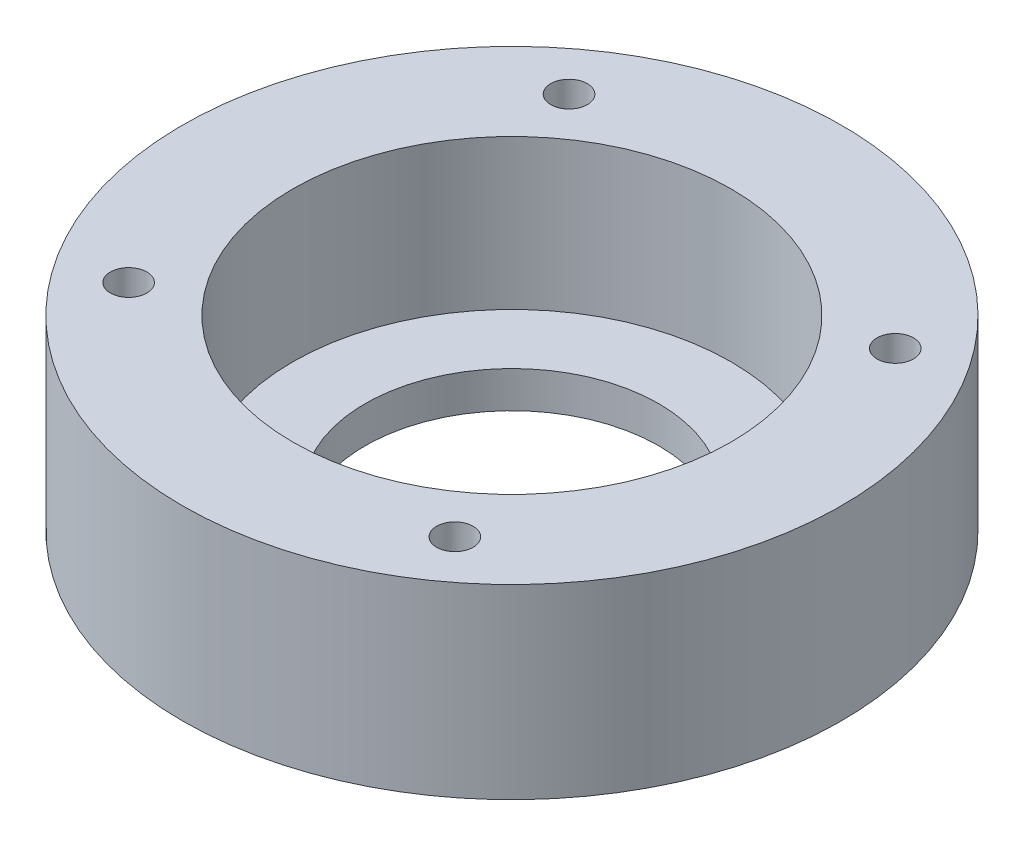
ISO-10303-21;
HEADER;
FILE_DESCRIPTION(('STEP AP214'),'2;1');
FILE_NAME('part.step','',(''),(''),'','','');
FILE_SCHEMA(('AUTOMOTIVE_DESIGN { 1 0 10303 214 1 1 1 1 }'));
ENDSEC;
DATA;
#1=APPLICATION_CONTEXT('core data for automotive mechanical design processes');
#2=APPLICATION_PROTOCOL_DEFINITION('international standard','automotive_design',2000,#1);
#3=PRODUCT_CONTEXT('',#1,'mechanical');
#4=PRODUCT('Part','Part','',(#3));
#5=PRODUCT_RELATED_PRODUCT_CATEGORY('part','',(#4));
#6=PRODUCT_DEFINITION_FORMATION('','',#4);
#7=PRODUCT_DEFINITION_CONTEXT('part definition',#1,'design');
#8=PRODUCT_DEFINITION('design','',#6,#7);
#9=PRODUCT_DEFINITION_SHAPE('','',#8);
#10=(LENGTH_UNIT() NAMED_UNIT(*) SI_UNIT(.MILLI.,.METRE.));
#11=(NAMED_UNIT(*) PLANE_ANGLE_UNIT() SI_UNIT($,.RADIAN.));
#12=(NAMED_UNIT(*) SI_UNIT($,.STERADIAN.) SOLID_ANGLE_UNIT());
#13=UNCERTAINTY_MEASURE_WITH_UNIT(LENGTH_MEASURE(1.E-05),#10,'distance_accuracy_value','');
#14=(GEOMETRIC_REPRESENTATION_CONTEXT(3) GLOBAL_UNCERTAINTY_ASSIGNED_CONTEXT((#13)) GLOBAL_UNIT_ASSIGNED_CONTEXT((#10,
#11,#12)) REPRESENTATION_CONTEXT('',''));
#15=CARTESIAN_POINT('',(0.,0.,0.));
#16=DIRECTION('',(0.,0.,1.));
#17=DIRECTION('',(1.,0.,0.));
#18=AXIS2_PLACEMENT_3D('',#15,#16,#17);
#19=CARTESIAN_POINT('',(0.,77.6026104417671,0.));
#20=DIRECTION('',(0.,1.,0.));
#21=DIRECTION('',(0.,0.,1.));
#22=AXIS2_PLACEMENT_3D('',#19,#20,#21);
#23=CYLINDRICAL_SURFACE('',#22,20.1);
#24=CARTESIAN_POINT('',(0.,0.,0.));
#25=DIRECTION('',(0.,1.,0.));
#26=DIRECTION('',(0.,0.,1.));
#27=AXIS2_PLACEMENT_3D('',#24,#25,#26);
#28=CIRCLE('',#27,20.1);
#29=CARTESIAN_POINT('',(0.,0.,20.1));
#30=VERTEX_POINT('',#29);
#31=EDGE_CURVE('E10',#30,#30,#28,.T.);
#32=ORIENTED_EDGE('',*,*,#31,.F.);
#33=EDGE_LOOP('',(#32));
#34=FACE_BOUND('',#33,.T.);
#35=CARTESIAN_POINT('',(0.,5.,0.));
#36=DIRECTION('',(0.,1.,0.));
#37=DIRECTION('',(0.,0.,1.));
#38=AXIS2_PLACEMENT_3D('',#35,#36,#37);
#39=CIRCLE('',#38,20.1);
#40=CARTESIAN_POINT('',(0.,5.,20.1));
#41=VERTEX_POINT('',#40);
#42=EDGE_CURVE('E50',#41,#41,#39,.T.);
#43=ORIENTED_EDGE('',*,*,#42,.T.);
#44=EDGE_LOOP('',(#43));
#45=FACE_BOUND('',#44,.T.);
#46=ADVANCED_FACE('F28',(#34,#45),#23,.F.);
#47=CARTESIAN_POINT('',(20.1,0.,0.));
#48=DIRECTION('',(0.,1.,0.));
#49=DIRECTION('',(0.,0.,1.));
#50=AXIS2_PLACEMENT_3D('',#47,#48,#49);
#51=PLANE('',#50);
#52=CARTESIAN_POINT('',(30.1328551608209,0.,-22.3217615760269));
#53=DIRECTION('',(0.,-1.,0.));
#54=DIRECTION('',(0.,0.,-1.));
#55=AXIS2_PLACEMENT_3D('',#52,#53,#54);
#56=CIRCLE('',#55,2.49999999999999);
#57=CARTESIAN_POINT('',(30.1328551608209,0.,-24.8217615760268));
#58=VERTEX_POINT('',#57);
#59=EDGE_CURVE('E74',#58,#58,#56,.T.);
#60=ORIENTED_EDGE('',*,*,#59,.F.);
#61=EDGE_LOOP('',(#60));
#62=FACE_BOUND('',#61,.T.);
#63=CARTESIAN_POINT('',(22.3217615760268,0.,30.132855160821));
#64=DIRECTION('',(0.,-1.,0.));
#65=DIRECTION('',(0.,0.,-1.));
#66=AXIS2_PLACEMENT_3D('',#63,#64,#65);
#67=CIRCLE('',#66,2.49999999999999);
#68=CARTESIAN_POINT('',(22.3217615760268,0.,27.632855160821));
#69=VERTEX_POINT('',#68);
#70=EDGE_CURVE('E68',#69,#69,#67,.T.);
#71=ORIENTED_EDGE('',*,*,#70,.F.);
#72=EDGE_LOOP('',(#71));
#73=FACE_BOUND('',#72,.T.);
#74=CARTESIAN_POINT('',(-30.1328551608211,0.,22.3217615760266));
#75=DIRECTION('',(0.,-1.,0.));
#76=DIRECTION('',(0.,0.,-1.));
#77=AXIS2_PLACEMENT_3D('',#74,#75,#76);
#78=CIRCLE('',#77,2.49999999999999);
#79=CARTESIAN_POINT('',(-30.1328551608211,0.,19.8217615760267));
#80=VERTEX_POINT('',#79);
#81=EDGE_CURVE('E62',#80,#80,#78,.T.);
#82=ORIENTED_EDGE('',*,*,#81,.F.);
#83=EDGE_LOOP('',(#82));
#84=FACE_BOUND('',#83,.T.);
#85=CARTESIAN_POINT('',(-22.3217615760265,0.,-30.1328551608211));
#86=DIRECTION('',(0.,-1.,0.));
#87=DIRECTION('',(0.,0.,-1.));
#88=AXIS2_PLACEMENT_3D('',#85,#86,#87);
#89=CIRCLE('',#88,2.49999999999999);
#90=CARTESIAN_POINT('',(-22.3217615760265,0.,-32.6328551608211));
#91=VERTEX_POINT('',#90);
#92=EDGE_CURVE('E56',#91,#91,#89,.T.);
#93=ORIENTED_EDGE('',*,*,#92,.F.);
#94=EDGE_LOOP('',(#93));
#95=FACE_BOUND('',#94,.T.);
#96=CARTESIAN_POINT('',(0.,0.,0.));
#97=DIRECTION('',(0.,1.,0.));
#98=DIRECTION('',(0.,0.,1.));
#99=AXIS2_PLACEMENT_3D('',#96,#97,#98);
#100=CIRCLE('',#99,45.1);
#101=CARTESIAN_POINT('',(0.,0.,45.1));
#102=VERTEX_POINT('',#101);
#103=EDGE_CURVE('E34',#102,#102,#100,.T.);
#104=ORIENTED_EDGE('',*,*,#103,.F.);
#105=EDGE_LOOP('',(#104));
#106=FACE_BOUND('',#105,.T.);
#107=ORIENTED_EDGE('',*,*,#31,.T.);
#108=EDGE_LOOP('',(#107));
#109=FACE_BOUND('',#108,.T.);
#110=ADVANCED_FACE('F80',(#62,#73,#84,#95,#106,#109),#51,.F.);
#111=CARTESIAN_POINT('',(0.,77.6026104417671,0.));
#112=DIRECTION('',(0.,1.,0.));
#113=DIRECTION('',(0.,0.,1.));
#114=AXIS2_PLACEMENT_3D('',#111,#112,#113);
#115=CYLINDRICAL_SURFACE('',#114,45.1);
#116=CARTESIAN_POINT('',(0.,25.5,0.));
#117=DIRECTION('',(0.,1.,0.));
#118=DIRECTION('',(0.,0.,1.));
#119=AXIS2_PLACEMENT_3D('',#116,#117,#118);
#120=CIRCLE('',#119,45.1);
#121=CARTESIAN_POINT('',(0.,25.5,45.1));
#122=VERTEX_POINT('',#121);
#123=EDGE_CURVE('E38',#122,#122,#120,.T.);
#124=ORIENTED_EDGE('',*,*,#123,.F.);
#125=EDGE_LOOP('',(#124));
#126=FACE_BOUND('',#125,.T.);
#127=ORIENTED_EDGE('',*,*,#103,.T.);
#128=EDGE_LOOP('',(#127));
#129=FACE_BOUND('',#128,.T.);
#130=ADVANCED_FACE('F83',(#126,#129),#115,.T.);
#131=CARTESIAN_POINT('',(45.1,25.5,0.));
#132=DIRECTION('',(0.,-1.,0.));
#133=DIRECTION('',(0.,0.,-1.));
#134=AXIS2_PLACEMENT_3D('',#131,#132,#133);
#135=PLANE('',#134);
#136=CARTESIAN_POINT('',(30.1328551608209,25.5,-22.3217615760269));
#137=DIRECTION('',(0.,-1.,0.));
#138=DIRECTION('',(0.,0.,-1.));
#139=AXIS2_PLACEMENT_3D('',#136,#137,#138);
#140=CIRCLE('',#139,2.5);
#141=CARTESIAN_POINT('',(30.1328551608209,25.5,-24.8217615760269));
#142=VERTEX_POINT('',#141);
#143=EDGE_CURVE('E71',#142,#142,#140,.T.);
#144=ORIENTED_EDGE('',*,*,#143,.T.);
#145=EDGE_LOOP('',(#144));
#146=FACE_BOUND('',#145,.T.);
#147=CARTESIAN_POINT('',(22.3217615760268,25.5,30.132855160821));
#148=DIRECTION('',(0.,-1.,0.));
#149=DIRECTION('',(0.,0.,-1.));
#150=AXIS2_PLACEMENT_3D('',#147,#148,#149);
#151=CIRCLE('',#150,2.5);
#152=CARTESIAN_POINT('',(22.3217615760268,25.5,27.632855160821));
#153=VERTEX_POINT('',#152);
#154=EDGE_CURVE('E65',#153,#153,#151,.T.);
#155=ORIENTED_EDGE('',*,*,#154,.T.);
#156=EDGE_LOOP('',(#155));
#157=FACE_BOUND('',#156,.T.);
#158=CARTESIAN_POINT('',(-30.1328551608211,25.5,22.3217615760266));
#159=DIRECTION('',(0.,-1.,0.));
#160=DIRECTION('',(0.,0.,-1.));
#161=AXIS2_PLACEMENT_3D('',#158,#159,#160);
#162=CIRCLE('',#161,2.5);
#163=CARTESIAN_POINT('',(-30.1328551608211,25.5,19.8217615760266));
#164=VERTEX_POINT('',#163);
#165=EDGE_CURVE('E59',#164,#164,#162,.T.);
#166=ORIENTED_EDGE('',*,*,#165,.T.);
#167=EDGE_LOOP('',(#166));
#168=FACE_BOUND('',#167,.T.);
#169=CARTESIAN_POINT('',(-22.3217615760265,25.5,-30.1328551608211));
#170=DIRECTION('',(0.,-1.,0.));
#171=DIRECTION('',(0.,0.,-1.));
#172=AXIS2_PLACEMENT_3D('',#169,#170,#171);
#173=CIRCLE('',#172,2.5);
#174=CARTESIAN_POINT('',(-22.3217615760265,25.5,-32.6328551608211));
#175=VERTEX_POINT('',#174);
#176=EDGE_CURVE('E53',#175,#175,#173,.T.);
#177=ORIENTED_EDGE('',*,*,#176,.T.);
#178=EDGE_LOOP('',(#177));
#179=FACE_BOUND('',#178,.T.);
#180=CARTESIAN_POINT('',(0.,25.5,0.));
#181=DIRECTION('',(0.,1.,0.));
#182=DIRECTION('',(0.,0.,1.));
#183=AXIS2_PLACEMENT_3D('',#180,#181,#182);
#184=CIRCLE('',#183,30.);
#185=CARTESIAN_POINT('',(0.,25.5,30.));
#186=VERTEX_POINT('',#185);
#187=EDGE_CURVE('E42',#186,#186,#184,.T.);
#188=ORIENTED_EDGE('',*,*,#187,.F.);
#189=EDGE_LOOP('',(#188));
#190=FACE_BOUND('',#189,.T.);
#191=ORIENTED_EDGE('',*,*,#123,.T.);
#192=EDGE_LOOP('',(#191));
#193=FACE_BOUND('',#192,.T.);
#194=ADVANCED_FACE('F119',(#146,#157,#168,#179,#190,#193),#135,.F.);
#195=CARTESIAN_POINT('',(0.,77.6026104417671,0.));
#196=DIRECTION('',(0.,1.,0.));
#197=DIRECTION('',(0.,0.,1.));
#198=AXIS2_PLACEMENT_3D('',#195,#196,#197);
#199=CYLINDRICAL_SURFACE('',#198,30.);
#200=CARTESIAN_POINT('',(0.,5.,0.));
#201=DIRECTION('',(0.,1.,0.));
#202=DIRECTION('',(0.,0.,1.));
#203=AXIS2_PLACEMENT_3D('',#200,#201,#202);
#204=CIRCLE('',#203,30.);
#205=CARTESIAN_POINT('',(0.,5.,30.));
#206=VERTEX_POINT('',#205);
#207=EDGE_CURVE('E47',#206,#206,#204,.T.);
#208=ORIENTED_EDGE('',*,*,#207,.F.);
#209=EDGE_LOOP('',(#208));
#210=FACE_BOUND('',#209,.T.);
#211=ORIENTED_EDGE('',*,*,#187,.T.);
#212=EDGE_LOOP('',(#211));
#213=FACE_BOUND('',#212,.T.);
#214=ADVANCED_FACE('F104',(#210,#213),#199,.F.);
#215=CARTESIAN_POINT('',(30.,5.,0.));
#216=DIRECTION('',(0.,-1.,0.));
#217=DIRECTION('',(0.,0.,-1.));
#218=AXIS2_PLACEMENT_3D('',#215,#216,#217);
#219=PLANE('',#218);
#220=ORIENTED_EDGE('',*,*,#42,.F.);
#221=EDGE_LOOP('',(#220));
#222=FACE_BOUND('',#221,.T.);
#223=ORIENTED_EDGE('',*,*,#207,.T.);
#224=EDGE_LOOP('',(#223));
#225=FACE_BOUND('',#224,.T.);
#226=ADVANCED_FACE('F94',(#222,#225),#219,.F.);
#227=CARTESIAN_POINT('',(-22.3217615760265,0.,-30.1328551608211));
#228=DIRECTION('',(0.,-1.,0.));
#229=DIRECTION('',(0.,0.,-1.));
#230=AXIS2_PLACEMENT_3D('',#227,#228,#229);
#231=CYLINDRICAL_SURFACE('',#230,2.49999999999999);
#232=ORIENTED_EDGE('',*,*,#176,.F.);
#233=EDGE_LOOP('',(#232));
#234=FACE_BOUND('',#233,.T.);
#235=ORIENTED_EDGE('',*,*,#92,.T.);
#236=EDGE_LOOP('',(#235));
#237=FACE_BOUND('',#236,.T.);
#238=ADVANCED_FACE('F91',(#234,#237),#231,.F.);
#239=CARTESIAN_POINT('',(-30.1328551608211,0.,22.3217615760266));
#240=DIRECTION('',(0.,-1.,0.));
#241=DIRECTION('',(0.,0.,-1.));
#242=AXIS2_PLACEMENT_3D('',#239,#240,#241);
#243=CYLINDRICAL_SURFACE('',#242,2.49999999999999);
#244=ORIENTED_EDGE('',*,*,#165,.F.);
#245=EDGE_LOOP('',(#244));
#246=FACE_BOUND('',#245,.T.);
#247=ORIENTED_EDGE('',*,*,#81,.T.);
#248=EDGE_LOOP('',(#247));
#249=FACE_BOUND('',#248,.T.);
#250=ADVANCED_FACE('F93',(#246,#249),#243,.F.);
#251=CARTESIAN_POINT('',(22.3217615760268,0.,30.132855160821));
#252=DIRECTION('',(0.,-1.,0.));
#253=DIRECTION('',(0.,0.,-1.));
#254=AXIS2_PLACEMENT_3D('',#251,#252,#253);
#255=CYLINDRICAL_SURFACE('',#254,2.49999999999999);
#256=ORIENTED_EDGE('',*,*,#154,.F.);
#257=EDGE_LOOP('',(#256));
#258=FACE_BOUND('',#257,.T.);
#259=ORIENTED_EDGE('',*,*,#70,.T.);
#260=EDGE_LOOP('',(#259));
#261=FACE_BOUND('',#260,.T.);
#262=ADVANCED_FACE('F101',(#258,#261),#255,.F.);
#263=CARTESIAN_POINT('',(30.1328551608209,0.,-22.3217615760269));
#264=DIRECTION('',(0.,-1.,0.));
#265=DIRECTION('',(0.,0.,-1.));
#266=AXIS2_PLACEMENT_3D('',#263,#264,#265);
#267=CYLINDRICAL_SURFACE('',#266,2.49999999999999);
#268=ORIENTED_EDGE('',*,*,#143,.F.);
#269=EDGE_LOOP('',(#268));
#270=FACE_BOUND('',#269,.T.);
#271=ORIENTED_EDGE('',*,*,#59,.T.);
#272=EDGE_LOOP('',(#271));
#273=FACE_BOUND('',#272,.T.);
#274=ADVANCED_FACE('F78',(#270,#273),#267,.F.);
#275=CLOSED_SHELL('',(#46,#110,#130,#194,#214,#226,#238,#250,#262,#274));
#276=MANIFOLD_SOLID_BREP('B2',#275);
#277=ADVANCED_BREP_SHAPE_REPRESENTATION('',(#18,#276),#14);
#278=SHAPE_DEFINITION_REPRESENTATION(#9,#277);
ENDSEC;
END-ISO-10303-21;
